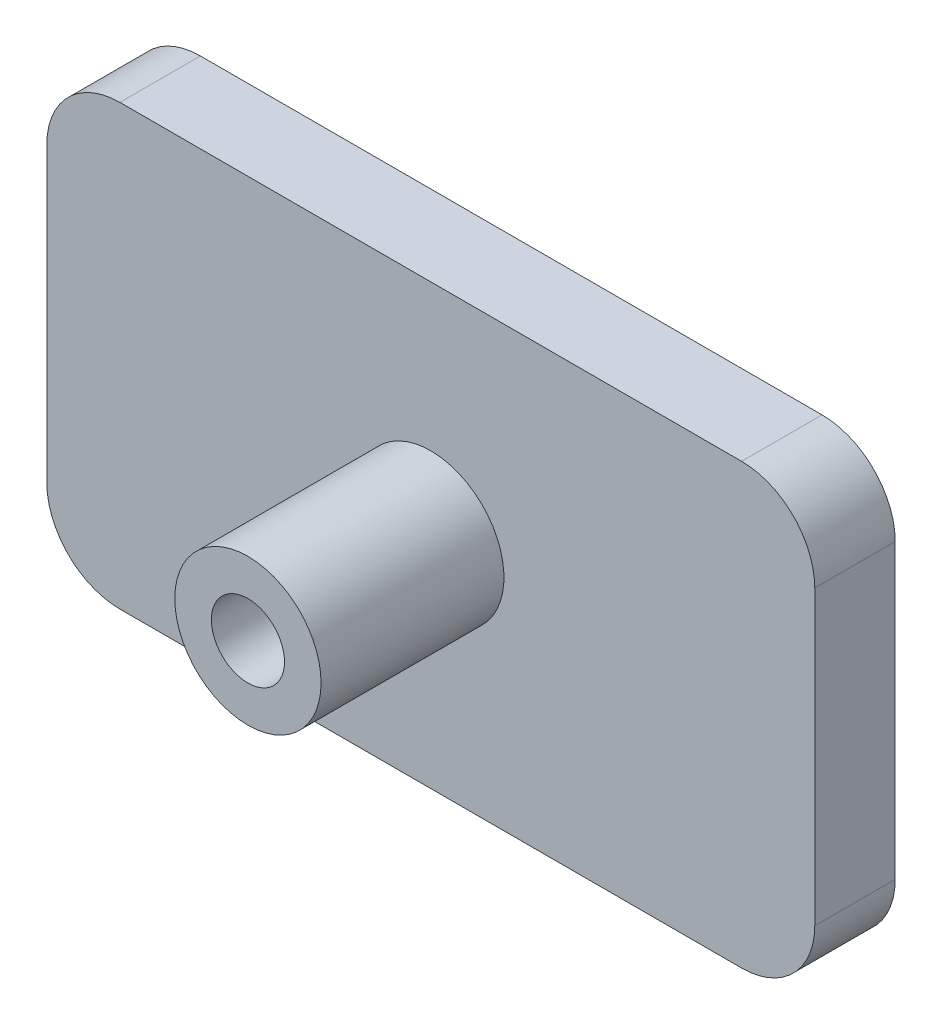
ISO-10303-21;
HEADER;
FILE_DESCRIPTION(('STEP AP214'),'2;1');
FILE_NAME('part.step','',(''),(''),'','','');
FILE_SCHEMA(('AUTOMOTIVE_DESIGN { 1 0 10303 214 1 1 1 1 }'));
ENDSEC;
DATA;
#1=APPLICATION_CONTEXT('core data for automotive mechanical design processes');
#2=APPLICATION_PROTOCOL_DEFINITION('international standard','automotive_design',2000,#1);
#3=PRODUCT_CONTEXT('',#1,'mechanical');
#4=PRODUCT('Part','Part','',(#3));
#5=PRODUCT_RELATED_PRODUCT_CATEGORY('part','',(#4));
#6=PRODUCT_DEFINITION_FORMATION('','',#4);
#7=PRODUCT_DEFINITION_CONTEXT('part definition',#1,'design');
#8=PRODUCT_DEFINITION('design','',#6,#7);
#9=PRODUCT_DEFINITION_SHAPE('','',#8);
#10=(LENGTH_UNIT() NAMED_UNIT(*) SI_UNIT(.MILLI.,.METRE.));
#11=(NAMED_UNIT(*) PLANE_ANGLE_UNIT() SI_UNIT($,.RADIAN.));
#12=(NAMED_UNIT(*) SI_UNIT($,.STERADIAN.) SOLID_ANGLE_UNIT());
#13=UNCERTAINTY_MEASURE_WITH_UNIT(LENGTH_MEASURE(1.E-05),#10,'distance_accuracy_value','');
#14=(GEOMETRIC_REPRESENTATION_CONTEXT(3) GLOBAL_UNCERTAINTY_ASSIGNED_CONTEXT((#13)) GLOBAL_UNIT_ASSIGNED_CONTEXT((#10,
#11,#12)) REPRESENTATION_CONTEXT('',''));
#15=CARTESIAN_POINT('',(0.,0.,0.));
#16=DIRECTION('',(0.,0.,1.));
#17=DIRECTION('',(1.,0.,0.));
#18=AXIS2_PLACEMENT_3D('',#15,#16,#17);
#19=CARTESIAN_POINT('',(-8.49999999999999,-4.,2.2));
#20=DIRECTION('',(0.,0.,-1.));
#21=DIRECTION('',(-1.,0.,0.));
#22=AXIS2_PLACEMENT_3D('',#19,#20,#21);
#23=PLANE('',#22);
#24=CARTESIAN_POINT('',(-8.49999999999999,-4.,2.2));
#25=DIRECTION('',(0.,0.,1.));
#26=DIRECTION('',(-1.,0.,0.));
#27=AXIS2_PLACEMENT_3D('',#24,#25,#26);
#28=CIRCLE('',#27,2.);
#29=CARTESIAN_POINT('',(-10.5,-3.99999999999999,2.2));
#30=VERTEX_POINT('',#29);
#31=CARTESIAN_POINT('',(-8.49999999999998,-6.,2.2));
#32=VERTEX_POINT('',#31);
#33=EDGE_CURVE('E157',#30,#32,#28,.T.);
#34=ORIENTED_EDGE('',*,*,#33,.T.);
#35=DIRECTION('',(1.,0.,0.));
#36=VECTOR('',#35,1.);
#37=CARTESIAN_POINT('',(-8.49999999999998,-6.,2.2));
#38=LINE('',#37,#36);
#39=CARTESIAN_POINT('',(8.49999999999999,-6.,2.2));
#40=VERTEX_POINT('',#39);
#41=EDGE_CURVE('E97',#32,#40,#38,.T.);
#42=ORIENTED_EDGE('',*,*,#41,.T.);
#43=CARTESIAN_POINT('',(8.50000000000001,-4.,2.2));
#44=DIRECTION('',(0.,0.,1.));
#45=DIRECTION('',(1.,0.,0.));
#46=AXIS2_PLACEMENT_3D('',#43,#44,#45);
#47=CIRCLE('',#46,2.);
#48=CARTESIAN_POINT('',(10.5,-3.99999999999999,2.2));
#49=VERTEX_POINT('',#48);
#50=EDGE_CURVE('E205',#40,#49,#47,.T.);
#51=ORIENTED_EDGE('',*,*,#50,.T.);
#52=DIRECTION('',(0.,1.,0.));
#53=VECTOR('',#52,1.);
#54=CARTESIAN_POINT('',(10.5,-3.99999999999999,2.2));
#55=LINE('',#54,#53);
#56=CARTESIAN_POINT('',(10.5,3.99999999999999,2.2));
#57=VERTEX_POINT('',#56);
#58=EDGE_CURVE('E207',#49,#57,#55,.T.);
#59=ORIENTED_EDGE('',*,*,#58,.T.);
#60=CARTESIAN_POINT('',(8.50000000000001,4.,2.2));
#61=DIRECTION('',(0.,0.,1.));
#62=DIRECTION('',(-1.,0.,0.));
#63=AXIS2_PLACEMENT_3D('',#60,#61,#62);
#64=CIRCLE('',#63,2.);
#65=CARTESIAN_POINT('',(8.49999999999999,6.,2.2));
#66=VERTEX_POINT('',#65);
#67=EDGE_CURVE('E120',#57,#66,#64,.T.);
#68=ORIENTED_EDGE('',*,*,#67,.T.);
#69=DIRECTION('',(-1.,0.,0.));
#70=VECTOR('',#69,1.);
#71=CARTESIAN_POINT('',(-8.49999999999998,6.,2.2));
#72=LINE('',#71,#70);
#73=CARTESIAN_POINT('',(-8.49999999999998,6.,2.2));
#74=VERTEX_POINT('',#73);
#75=EDGE_CURVE('E113',#66,#74,#72,.T.);
#76=ORIENTED_EDGE('',*,*,#75,.T.);
#77=CARTESIAN_POINT('',(-8.49999999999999,4.,2.2));
#78=DIRECTION('',(0.,0.,1.));
#79=DIRECTION('',(-1.,0.,0.));
#80=AXIS2_PLACEMENT_3D('',#77,#78,#79);
#81=CIRCLE('',#80,2.);
#82=CARTESIAN_POINT('',(-10.5,3.99999999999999,2.2));
#83=VERTEX_POINT('',#82);
#84=EDGE_CURVE('E117',#74,#83,#81,.T.);
#85=ORIENTED_EDGE('',*,*,#84,.T.);
#86=DIRECTION('',(0.,-1.,0.));
#87=VECTOR('',#86,1.);
#88=CARTESIAN_POINT('',(-10.5,-3.99999999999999,2.2));
#89=LINE('',#88,#87);
#90=EDGE_CURVE('E55',#83,#30,#89,.T.);
#91=ORIENTED_EDGE('',*,*,#90,.T.);
#92=EDGE_LOOP('',(#34,#42,#51,#59,#68,#76,#85,#91));
#93=FACE_BOUND('',#92,.T.);
#94=CARTESIAN_POINT('',(0.,0.,2.2));
#95=DIRECTION('',(0.,0.,-1.));
#96=DIRECTION('',(-1.,0.,0.));
#97=AXIS2_PLACEMENT_3D('',#94,#95,#96);
#98=CIRCLE('',#97,2.);
#99=CARTESIAN_POINT('',(-2.,0.,2.2));
#100=VERTEX_POINT('',#99);
#101=EDGE_CURVE('E11',#100,#100,#98,.F.);
#102=ORIENTED_EDGE('',*,*,#101,.F.);
#103=EDGE_LOOP('',(#102));
#104=FACE_BOUND('',#103,.T.);
#105=ADVANCED_FACE('F31',(#93,#104),#23,.F.);
#106=CARTESIAN_POINT('',(-8.49999999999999,-4.,0.));
#107=DIRECTION('',(0.,0.,-1.));
#108=DIRECTION('',(-1.,0.,0.));
#109=AXIS2_PLACEMENT_3D('',#106,#107,#108);
#110=PLANE('',#109);
#111=CARTESIAN_POINT('',(-8.5,4.,0.));
#112=DIRECTION('',(0.,0.,-1.));
#113=DIRECTION('',(1.,0.,0.));
#114=AXIS2_PLACEMENT_3D('',#111,#112,#113);
#115=CIRCLE('',#114,1.);
#116=CARTESIAN_POINT('',(-9.5,3.99999999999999,0.));
#117=VERTEX_POINT('',#116);
#118=CARTESIAN_POINT('',(-8.49999999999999,5.,0.));
#119=VERTEX_POINT('',#118);
#120=EDGE_CURVE('E46',#117,#119,#115,.T.);
#121=ORIENTED_EDGE('',*,*,#120,.F.);
#122=DIRECTION('',(0.,1.,0.));
#123=VECTOR('',#122,1.);
#124=CARTESIAN_POINT('',(-9.5,-3.99999999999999,0.));
#125=LINE('',#124,#123);
#126=CARTESIAN_POINT('',(-9.5,-3.99999999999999,0.));
#127=VERTEX_POINT('',#126);
#128=EDGE_CURVE('E183',#127,#117,#125,.T.);
#129=ORIENTED_EDGE('',*,*,#128,.F.);
#130=CARTESIAN_POINT('',(-8.5,-4.,0.));
#131=DIRECTION('',(0.,0.,-1.));
#132=DIRECTION('',(-1.,0.,0.));
#133=AXIS2_PLACEMENT_3D('',#130,#131,#132);
#134=CIRCLE('',#133,1.);
#135=CARTESIAN_POINT('',(-8.49999999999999,-5.,0.));
#136=VERTEX_POINT('',#135);
#137=EDGE_CURVE('E477',#136,#127,#134,.T.);
#138=ORIENTED_EDGE('',*,*,#137,.F.);
#139=DIRECTION('',(-1.,0.,0.));
#140=VECTOR('',#139,1.);
#141=CARTESIAN_POINT('',(8.49999999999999,-5.,0.));
#142=LINE('',#141,#140);
#143=CARTESIAN_POINT('',(8.49999999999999,-5.,0.));
#144=VERTEX_POINT('',#143);
#145=EDGE_CURVE('E475',#144,#136,#142,.T.);
#146=ORIENTED_EDGE('',*,*,#145,.F.);
#147=CARTESIAN_POINT('',(8.5,-4.,0.));
#148=DIRECTION('',(0.,0.,-1.));
#149=DIRECTION('',(1.,0.,0.));
#150=AXIS2_PLACEMENT_3D('',#147,#148,#149);
#151=CIRCLE('',#150,1.);
#152=CARTESIAN_POINT('',(9.5,-3.99999999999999,0.));
#153=VERTEX_POINT('',#152);
#154=EDGE_CURVE('E472',#153,#144,#151,.T.);
#155=ORIENTED_EDGE('',*,*,#154,.F.);
#156=DIRECTION('',(0.,-1.,0.));
#157=VECTOR('',#156,1.);
#158=CARTESIAN_POINT('',(9.5,-3.99999999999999,0.));
#159=LINE('',#158,#157);
#160=CARTESIAN_POINT('',(9.5,3.99999999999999,0.));
#161=VERTEX_POINT('',#160);
#162=EDGE_CURVE('E469',#161,#153,#159,.T.);
#163=ORIENTED_EDGE('',*,*,#162,.F.);
#164=CARTESIAN_POINT('',(8.5,4.,0.));
#165=DIRECTION('',(0.,0.,-1.));
#166=DIRECTION('',(1.,0.,0.));
#167=AXIS2_PLACEMENT_3D('',#164,#165,#166);
#168=CIRCLE('',#167,1.);
#169=CARTESIAN_POINT('',(8.49999999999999,5.,0.));
#170=VERTEX_POINT('',#169);
#171=EDGE_CURVE('E466',#170,#161,#168,.T.);
#172=ORIENTED_EDGE('',*,*,#171,.F.);
#173=DIRECTION('',(1.,0.,0.));
#174=VECTOR('',#173,1.);
#175=CARTESIAN_POINT('',(8.49999999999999,5.,0.));
#176=LINE('',#175,#174);
#177=EDGE_CURVE('E436',#119,#170,#176,.T.);
#178=ORIENTED_EDGE('',*,*,#177,.F.);
#179=EDGE_LOOP('',(#121,#129,#138,#146,#155,#163,#172,#178));
#180=FACE_BOUND('',#179,.T.);
#181=CARTESIAN_POINT('',(-8.49999999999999,-4.,0.));
#182=DIRECTION('',(0.,0.,1.));
#183=DIRECTION('',(-1.,0.,0.));
#184=AXIS2_PLACEMENT_3D('',#181,#182,#183);
#185=CIRCLE('',#184,2.);
#186=CARTESIAN_POINT('',(-10.5,-3.99999999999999,0.));
#187=VERTEX_POINT('',#186);
#188=CARTESIAN_POINT('',(-8.49999999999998,-6.,0.));
#189=VERTEX_POINT('',#188);
#190=EDGE_CURVE('E141',#187,#189,#185,.T.);
#191=ORIENTED_EDGE('',*,*,#190,.F.);
#192=DIRECTION('',(0.,-1.,0.));
#193=VECTOR('',#192,1.);
#194=CARTESIAN_POINT('',(-10.5,-3.99999999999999,0.));
#195=LINE('',#194,#193);
#196=CARTESIAN_POINT('',(-10.5,3.99999999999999,0.));
#197=VERTEX_POINT('',#196);
#198=EDGE_CURVE('E88',#197,#187,#195,.T.);
#199=ORIENTED_EDGE('',*,*,#198,.F.);
#200=CARTESIAN_POINT('',(-8.49999999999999,4.,0.));
#201=DIRECTION('',(0.,0.,1.));
#202=DIRECTION('',(-1.,0.,0.));
#203=AXIS2_PLACEMENT_3D('',#200,#201,#202);
#204=CIRCLE('',#203,2.);
#205=CARTESIAN_POINT('',(-8.49999999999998,6.,0.));
#206=VERTEX_POINT('',#205);
#207=EDGE_CURVE('E154',#206,#197,#204,.T.);
#208=ORIENTED_EDGE('',*,*,#207,.F.);
#209=DIRECTION('',(-1.,0.,0.));
#210=VECTOR('',#209,1.);
#211=CARTESIAN_POINT('',(-8.49999999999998,6.,0.));
#212=LINE('',#211,#210);
#213=CARTESIAN_POINT('',(8.49999999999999,6.,0.));
#214=VERTEX_POINT('',#213);
#215=EDGE_CURVE('E129',#214,#206,#212,.T.);
#216=ORIENTED_EDGE('',*,*,#215,.F.);
#217=CARTESIAN_POINT('',(8.50000000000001,4.,0.));
#218=DIRECTION('',(0.,0.,1.));
#219=DIRECTION('',(-1.,0.,0.));
#220=AXIS2_PLACEMENT_3D('',#217,#218,#219);
#221=CIRCLE('',#220,2.);
#222=CARTESIAN_POINT('',(10.5,3.99999999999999,0.));
#223=VERTEX_POINT('',#222);
#224=EDGE_CURVE('E151',#223,#214,#221,.T.);
#225=ORIENTED_EDGE('',*,*,#224,.F.);
#226=DIRECTION('',(0.,1.,0.));
#227=VECTOR('',#226,1.);
#228=CARTESIAN_POINT('',(10.5,-3.99999999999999,0.));
#229=LINE('',#228,#227);
#230=CARTESIAN_POINT('',(10.5,-3.99999999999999,0.));
#231=VERTEX_POINT('',#230);
#232=EDGE_CURVE('E149',#231,#223,#229,.T.);
#233=ORIENTED_EDGE('',*,*,#232,.F.);
#234=CARTESIAN_POINT('',(8.50000000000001,-4.,0.));
#235=DIRECTION('',(0.,0.,1.));
#236=DIRECTION('',(1.,0.,0.));
#237=AXIS2_PLACEMENT_3D('',#234,#235,#236);
#238=CIRCLE('',#237,2.);
#239=CARTESIAN_POINT('',(8.49999999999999,-6.,0.));
#240=VERTEX_POINT('',#239);
#241=EDGE_CURVE('E147',#240,#231,#238,.T.);
#242=ORIENTED_EDGE('',*,*,#241,.F.);
#243=DIRECTION('',(1.,0.,0.));
#244=VECTOR('',#243,1.);
#245=CARTESIAN_POINT('',(-8.49999999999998,-6.,0.));
#246=LINE('',#245,#244);
#247=EDGE_CURVE('E144',#189,#240,#246,.T.);
#248=ORIENTED_EDGE('',*,*,#247,.F.);
#249=EDGE_LOOP('',(#191,#199,#208,#216,#225,#233,#242,#248));
#250=FACE_BOUND('',#249,.T.);
#251=ADVANCED_FACE('F220',(#180,#250),#110,.T.);
#252=CARTESIAN_POINT('',(-8.49999999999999,-4.,2.2));
#253=DIRECTION('',(0.,0.,-1.));
#254=DIRECTION('',(-1.,0.,0.));
#255=AXIS2_PLACEMENT_3D('',#252,#253,#254);
#256=CYLINDRICAL_SURFACE('',#255,2.);
#257=ORIENTED_EDGE('',*,*,#190,.T.);
#258=DIRECTION('',(0.,0.,-1.));
#259=VECTOR('',#258,1.);
#260=CARTESIAN_POINT('',(-8.49999999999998,-6.,2.2));
#261=LINE('',#260,#259);
#262=EDGE_CURVE('E39',#32,#189,#261,.T.);
#263=ORIENTED_EDGE('',*,*,#262,.F.);
#264=ORIENTED_EDGE('',*,*,#33,.F.);
#265=DIRECTION('',(0.,0.,-1.));
#266=VECTOR('',#265,1.);
#267=CARTESIAN_POINT('',(-10.5,-3.99999999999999,2.2));
#268=LINE('',#267,#266);
#269=EDGE_CURVE('E137',#30,#187,#268,.T.);
#270=ORIENTED_EDGE('',*,*,#269,.T.);
#271=EDGE_LOOP('',(#257,#263,#264,#270));
#272=FACE_BOUND('',#271,.T.);
#273=ADVANCED_FACE('F33',(#272),#256,.T.);
#274=CARTESIAN_POINT('',(-8.49999999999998,-6.,2.2));
#275=DIRECTION('',(0.,1.,0.));
#276=DIRECTION('',(0.,0.,1.));
#277=AXIS2_PLACEMENT_3D('',#274,#275,#276);
#278=PLANE('',#277);
#279=ORIENTED_EDGE('',*,*,#247,.T.);
#280=DIRECTION('',(0.,0.,-1.));
#281=VECTOR('',#280,1.);
#282=CARTESIAN_POINT('',(8.49999999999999,-6.,2.2));
#283=LINE('',#282,#281);
#284=EDGE_CURVE('E167',#40,#240,#283,.T.);
#285=ORIENTED_EDGE('',*,*,#284,.F.);
#286=ORIENTED_EDGE('',*,*,#41,.F.);
#287=ORIENTED_EDGE('',*,*,#262,.T.);
#288=EDGE_LOOP('',(#279,#285,#286,#287));
#289=FACE_BOUND('',#288,.T.);
#290=ADVANCED_FACE('F225',(#289),#278,.F.);
#291=CARTESIAN_POINT('',(8.50000000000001,-4.,2.2));
#292=DIRECTION('',(0.,0.,-1.));
#293=DIRECTION('',(-1.,0.,0.));
#294=AXIS2_PLACEMENT_3D('',#291,#292,#293);
#295=CYLINDRICAL_SURFACE('',#294,2.);
#296=ORIENTED_EDGE('',*,*,#241,.T.);
#297=DIRECTION('',(0.,0.,-1.));
#298=VECTOR('',#297,1.);
#299=CARTESIAN_POINT('',(10.5,-3.99999999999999,2.2));
#300=LINE('',#299,#298);
#301=EDGE_CURVE('E164',#49,#231,#300,.T.);
#302=ORIENTED_EDGE('',*,*,#301,.F.);
#303=ORIENTED_EDGE('',*,*,#50,.F.);
#304=ORIENTED_EDGE('',*,*,#284,.T.);
#305=EDGE_LOOP('',(#296,#302,#303,#304));
#306=FACE_BOUND('',#305,.T.);
#307=ADVANCED_FACE('F228',(#306),#295,.T.);
#308=CARTESIAN_POINT('',(10.5,-3.99999999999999,2.2));
#309=DIRECTION('',(-1.,0.,0.));
#310=DIRECTION('',(0.,0.,1.));
#311=AXIS2_PLACEMENT_3D('',#308,#309,#310);
#312=PLANE('',#311);
#313=ORIENTED_EDGE('',*,*,#232,.T.);
#314=DIRECTION('',(0.,0.,-1.));
#315=VECTOR('',#314,1.);
#316=CARTESIAN_POINT('',(10.5,3.99999999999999,2.2));
#317=LINE('',#316,#315);
#318=EDGE_CURVE('E161',#57,#223,#317,.T.);
#319=ORIENTED_EDGE('',*,*,#318,.F.);
#320=ORIENTED_EDGE('',*,*,#58,.F.);
#321=ORIENTED_EDGE('',*,*,#301,.T.);
#322=EDGE_LOOP('',(#313,#319,#320,#321));
#323=FACE_BOUND('',#322,.T.);
#324=ADVANCED_FACE('F213',(#323),#312,.F.);
#325=CARTESIAN_POINT('',(8.50000000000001,4.,2.2));
#326=DIRECTION('',(0.,0.,-1.));
#327=DIRECTION('',(-1.,0.,0.));
#328=AXIS2_PLACEMENT_3D('',#325,#326,#327);
#329=CYLINDRICAL_SURFACE('',#328,2.);
#330=ORIENTED_EDGE('',*,*,#224,.T.);
#331=DIRECTION('',(0.,0.,-1.));
#332=VECTOR('',#331,1.);
#333=CARTESIAN_POINT('',(8.49999999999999,6.,2.2));
#334=LINE('',#333,#332);
#335=EDGE_CURVE('E132',#66,#214,#334,.T.);
#336=ORIENTED_EDGE('',*,*,#335,.F.);
#337=ORIENTED_EDGE('',*,*,#67,.F.);
#338=ORIENTED_EDGE('',*,*,#318,.T.);
#339=EDGE_LOOP('',(#330,#336,#337,#338));
#340=FACE_BOUND('',#339,.T.);
#341=ADVANCED_FACE('F217',(#340),#329,.T.);
#342=CARTESIAN_POINT('',(-8.49999999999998,6.,2.2));
#343=DIRECTION('',(0.,-1.,0.));
#344=DIRECTION('',(0.,0.,-1.));
#345=AXIS2_PLACEMENT_3D('',#342,#343,#344);
#346=PLANE('',#345);
#347=ORIENTED_EDGE('',*,*,#215,.T.);
#348=DIRECTION('',(0.,0.,-1.));
#349=VECTOR('',#348,1.);
#350=CARTESIAN_POINT('',(-8.49999999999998,6.,2.2));
#351=LINE('',#350,#349);
#352=EDGE_CURVE('E126',#74,#206,#351,.T.);
#353=ORIENTED_EDGE('',*,*,#352,.F.);
#354=ORIENTED_EDGE('',*,*,#75,.F.);
#355=ORIENTED_EDGE('',*,*,#335,.T.);
#356=EDGE_LOOP('',(#347,#353,#354,#355));
#357=FACE_BOUND('',#356,.T.);
#358=ADVANCED_FACE('F127',(#357),#346,.F.);
#359=CARTESIAN_POINT('',(-8.49999999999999,4.,2.2));
#360=DIRECTION('',(0.,0.,-1.));
#361=DIRECTION('',(-1.,0.,0.));
#362=AXIS2_PLACEMENT_3D('',#359,#360,#361);
#363=CYLINDRICAL_SURFACE('',#362,2.);
#364=ORIENTED_EDGE('',*,*,#207,.T.);
#365=DIRECTION('',(0.,0.,-1.));
#366=VECTOR('',#365,1.);
#367=CARTESIAN_POINT('',(-10.5,3.99999999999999,2.2));
#368=LINE('',#367,#366);
#369=EDGE_CURVE('E133',#83,#197,#368,.T.);
#370=ORIENTED_EDGE('',*,*,#369,.F.);
#371=ORIENTED_EDGE('',*,*,#84,.F.);
#372=ORIENTED_EDGE('',*,*,#352,.T.);
#373=EDGE_LOOP('',(#364,#370,#371,#372));
#374=FACE_BOUND('',#373,.T.);
#375=ADVANCED_FACE('F135',(#374),#363,.T.);
#376=CARTESIAN_POINT('',(-10.5,-3.99999999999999,2.2));
#377=DIRECTION('',(1.,0.,0.));
#378=DIRECTION('',(0.,0.,-1.));
#379=AXIS2_PLACEMENT_3D('',#376,#377,#378);
#380=PLANE('',#379);
#381=ORIENTED_EDGE('',*,*,#198,.T.);
#382=ORIENTED_EDGE('',*,*,#269,.F.);
#383=ORIENTED_EDGE('',*,*,#90,.F.);
#384=ORIENTED_EDGE('',*,*,#369,.T.);
#385=EDGE_LOOP('',(#381,#382,#383,#384));
#386=FACE_BOUND('',#385,.T.);
#387=ADVANCED_FACE('F221',(#386),#380,.F.);
#388=CARTESIAN_POINT('',(0.,0.,2.2));
#389=DIRECTION('',(0.,0.,-1.));
#390=DIRECTION('',(-1.,0.,0.));
#391=AXIS2_PLACEMENT_3D('',#388,#389,#390);
#392=CYLINDRICAL_SURFACE('',#391,1.);
#393=CARTESIAN_POINT('',(0.,0.,1.1));
#394=DIRECTION('',(0.,0.,1.));
#395=DIRECTION('',(1.,0.,0.));
#396=AXIS2_PLACEMENT_3D('',#393,#394,#395);
#397=CIRCLE('',#396,1.);
#398=CARTESIAN_POINT('',(1.00000000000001,0.,1.1));
#399=VERTEX_POINT('',#398);
#400=EDGE_CURVE('E145',#399,#399,#397,.T.);
#401=ORIENTED_EDGE('',*,*,#400,.F.);
#402=EDGE_LOOP('',(#401));
#403=FACE_BOUND('',#402,.T.);
#404=CARTESIAN_POINT('',(0.,0.,7.2));
#405=DIRECTION('',(0.,0.,1.));
#406=DIRECTION('',(1.,0.,0.));
#407=AXIS2_PLACEMENT_3D('',#404,#405,#406);
#408=CIRCLE('',#407,1.00000000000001);
#409=CARTESIAN_POINT('',(1.00000000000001,0.,7.2));
#410=VERTEX_POINT('',#409);
#411=EDGE_CURVE('E434',#410,#410,#408,.T.);
#412=ORIENTED_EDGE('',*,*,#411,.T.);
#413=EDGE_LOOP('',(#412));
#414=FACE_BOUND('',#413,.T.);
#415=ADVANCED_FACE('F244',(#403,#414),#392,.F.);
#416=CARTESIAN_POINT('',(-8.5,4.,1.1));
#417=DIRECTION('',(0.,0.,-1.));
#418=DIRECTION('',(-1.,0.,0.));
#419=AXIS2_PLACEMENT_3D('',#416,#417,#418);
#420=CYLINDRICAL_SURFACE('',#419,1.);
#421=ORIENTED_EDGE('',*,*,#120,.T.);
#422=DIRECTION('',(0.,0.,-1.));
#423=VECTOR('',#422,1.);
#424=CARTESIAN_POINT('',(-8.49999999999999,5.,1.1));
#425=LINE('',#424,#423);
#426=CARTESIAN_POINT('',(-8.49999999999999,5.,1.1));
#427=VERTEX_POINT('',#426);
#428=EDGE_CURVE('E200',#427,#119,#425,.T.);
#429=ORIENTED_EDGE('',*,*,#428,.F.);
#430=CARTESIAN_POINT('',(-8.5,4.,1.1));
#431=DIRECTION('',(0.,0.,-1.));
#432=DIRECTION('',(1.,0.,0.));
#433=AXIS2_PLACEMENT_3D('',#430,#431,#432);
#434=CIRCLE('',#433,1.);
#435=CARTESIAN_POINT('',(-9.5,3.99999999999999,1.1));
#436=VERTEX_POINT('',#435);
#437=EDGE_CURVE('E441',#436,#427,#434,.T.);
#438=ORIENTED_EDGE('',*,*,#437,.F.);
#439=DIRECTION('',(0.,0.,-1.));
#440=VECTOR('',#439,1.);
#441=CARTESIAN_POINT('',(-9.5,3.99999999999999,1.1));
#442=LINE('',#441,#440);
#443=EDGE_CURVE('E171',#436,#117,#442,.T.);
#444=ORIENTED_EDGE('',*,*,#443,.T.);
#445=EDGE_LOOP('',(#421,#429,#438,#444));
#446=FACE_BOUND('',#445,.T.);
#447=ADVANCED_FACE('F277',(#446),#420,.F.);
#448=CARTESIAN_POINT('',(-9.5,-3.99999999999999,1.1));
#449=DIRECTION('',(-1.,0.,0.));
#450=DIRECTION('',(0.,0.,1.));
#451=AXIS2_PLACEMENT_3D('',#448,#449,#450);
#452=PLANE('',#451);
#453=ORIENTED_EDGE('',*,*,#128,.T.);
#454=ORIENTED_EDGE('',*,*,#443,.F.);
#455=DIRECTION('',(0.,1.,0.));
#456=VECTOR('',#455,1.);
#457=CARTESIAN_POINT('',(-9.5,-3.99999999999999,1.1));
#458=LINE('',#457,#456);
#459=CARTESIAN_POINT('',(-9.5,-3.99999999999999,1.1));
#460=VERTEX_POINT('',#459);
#461=EDGE_CURVE('E202',#460,#436,#458,.T.);
#462=ORIENTED_EDGE('',*,*,#461,.F.);
#463=DIRECTION('',(0.,0.,-1.));
#464=VECTOR('',#463,1.);
#465=CARTESIAN_POINT('',(-9.5,-3.99999999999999,1.1));
#466=LINE('',#465,#464);
#467=EDGE_CURVE('E174',#460,#127,#466,.T.);
#468=ORIENTED_EDGE('',*,*,#467,.T.);
#469=EDGE_LOOP('',(#453,#454,#462,#468));
#470=FACE_BOUND('',#469,.T.);
#471=ADVANCED_FACE('F285',(#470),#452,.F.);
#472=CARTESIAN_POINT('',(-8.5,-4.,1.1));
#473=DIRECTION('',(0.,0.,-1.));
#474=DIRECTION('',(-1.,0.,0.));
#475=AXIS2_PLACEMENT_3D('',#472,#473,#474);
#476=CYLINDRICAL_SURFACE('',#475,1.);
#477=ORIENTED_EDGE('',*,*,#137,.T.);
#478=ORIENTED_EDGE('',*,*,#467,.F.);
#479=CARTESIAN_POINT('',(-8.5,-4.,1.1));
#480=DIRECTION('',(0.,0.,-1.));
#481=DIRECTION('',(-1.,0.,0.));
#482=AXIS2_PLACEMENT_3D('',#479,#480,#481);
#483=CIRCLE('',#482,1.);
#484=CARTESIAN_POINT('',(-8.49999999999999,-5.,1.1));
#485=VERTEX_POINT('',#484);
#486=EDGE_CURVE('E459',#485,#460,#483,.T.);
#487=ORIENTED_EDGE('',*,*,#486,.F.);
#488=DIRECTION('',(0.,0.,-1.));
#489=VECTOR('',#488,1.);
#490=CARTESIAN_POINT('',(-8.49999999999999,-5.,1.1));
#491=LINE('',#490,#489);
#492=EDGE_CURVE('E180',#485,#136,#491,.T.);
#493=ORIENTED_EDGE('',*,*,#492,.T.);
#494=EDGE_LOOP('',(#477,#478,#487,#493));
#495=FACE_BOUND('',#494,.T.);
#496=ADVANCED_FACE('F291',(#495),#476,.F.);
#497=CARTESIAN_POINT('',(8.49999999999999,-5.,1.1));
#498=DIRECTION('',(0.,-1.,0.));
#499=DIRECTION('',(0.,0.,-1.));
#500=AXIS2_PLACEMENT_3D('',#497,#498,#499);
#501=PLANE('',#500);
#502=ORIENTED_EDGE('',*,*,#145,.T.);
#503=ORIENTED_EDGE('',*,*,#492,.F.);
#504=DIRECTION('',(-1.,0.,0.));
#505=VECTOR('',#504,1.);
#506=CARTESIAN_POINT('',(8.49999999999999,-5.,1.1));
#507=LINE('',#506,#505);
#508=CARTESIAN_POINT('',(8.49999999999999,-5.,1.1));
#509=VERTEX_POINT('',#508);
#510=EDGE_CURVE('E456',#509,#485,#507,.T.);
#511=ORIENTED_EDGE('',*,*,#510,.F.);
#512=DIRECTION('',(0.,0.,-1.));
#513=VECTOR('',#512,1.);
#514=CARTESIAN_POINT('',(8.49999999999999,-5.,1.1));
#515=LINE('',#514,#513);
#516=EDGE_CURVE('E188',#509,#144,#515,.T.);
#517=ORIENTED_EDGE('',*,*,#516,.T.);
#518=EDGE_LOOP('',(#502,#503,#511,#517));
#519=FACE_BOUND('',#518,.T.);
#520=ADVANCED_FACE('F299',(#519),#501,.F.);
#521=CARTESIAN_POINT('',(8.5,-4.,1.1));
#522=DIRECTION('',(0.,0.,-1.));
#523=DIRECTION('',(-1.,0.,0.));
#524=AXIS2_PLACEMENT_3D('',#521,#522,#523);
#525=CYLINDRICAL_SURFACE('',#524,1.);
#526=ORIENTED_EDGE('',*,*,#154,.T.);
#527=ORIENTED_EDGE('',*,*,#516,.F.);
#528=CARTESIAN_POINT('',(8.5,-4.,1.1));
#529=DIRECTION('',(0.,0.,-1.));
#530=DIRECTION('',(1.,0.,0.));
#531=AXIS2_PLACEMENT_3D('',#528,#529,#530);
#532=CIRCLE('',#531,1.);
#533=CARTESIAN_POINT('',(9.5,-3.99999999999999,1.1));
#534=VERTEX_POINT('',#533);
#535=EDGE_CURVE('E453',#534,#509,#532,.T.);
#536=ORIENTED_EDGE('',*,*,#535,.F.);
#537=DIRECTION('',(0.,0.,-1.));
#538=VECTOR('',#537,1.);
#539=CARTESIAN_POINT('',(9.5,-3.99999999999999,1.1));
#540=LINE('',#539,#538);
#541=EDGE_CURVE('E191',#534,#153,#540,.T.);
#542=ORIENTED_EDGE('',*,*,#541,.T.);
#543=EDGE_LOOP('',(#526,#527,#536,#542));
#544=FACE_BOUND('',#543,.T.);
#545=ADVANCED_FACE('F307',(#544),#525,.F.);
#546=CARTESIAN_POINT('',(9.5,-3.99999999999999,1.1));
#547=DIRECTION('',(1.,0.,0.));
#548=DIRECTION('',(0.,0.,-1.));
#549=AXIS2_PLACEMENT_3D('',#546,#547,#548);
#550=PLANE('',#549);
#551=ORIENTED_EDGE('',*,*,#162,.T.);
#552=ORIENTED_EDGE('',*,*,#541,.F.);
#553=DIRECTION('',(0.,-1.,0.));
#554=VECTOR('',#553,1.);
#555=CARTESIAN_POINT('',(9.5,-3.99999999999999,1.1));
#556=LINE('',#555,#554);
#557=CARTESIAN_POINT('',(9.5,3.99999999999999,1.1));
#558=VERTEX_POINT('',#557);
#559=EDGE_CURVE('E450',#558,#534,#556,.T.);
#560=ORIENTED_EDGE('',*,*,#559,.F.);
#561=DIRECTION('',(0.,0.,-1.));
#562=VECTOR('',#561,1.);
#563=CARTESIAN_POINT('',(9.5,3.99999999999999,1.1));
#564=LINE('',#563,#562);
#565=EDGE_CURVE('E194',#558,#161,#564,.T.);
#566=ORIENTED_EDGE('',*,*,#565,.T.);
#567=EDGE_LOOP('',(#551,#552,#560,#566));
#568=FACE_BOUND('',#567,.T.);
#569=ADVANCED_FACE('F315',(#568),#550,.F.);
#570=CARTESIAN_POINT('',(8.5,4.,1.1));
#571=DIRECTION('',(0.,0.,-1.));
#572=DIRECTION('',(-1.,0.,0.));
#573=AXIS2_PLACEMENT_3D('',#570,#571,#572);
#574=CYLINDRICAL_SURFACE('',#573,1.);
#575=ORIENTED_EDGE('',*,*,#171,.T.);
#576=ORIENTED_EDGE('',*,*,#565,.F.);
#577=CARTESIAN_POINT('',(8.5,4.,1.1));
#578=DIRECTION('',(0.,0.,-1.));
#579=DIRECTION('',(1.,0.,0.));
#580=AXIS2_PLACEMENT_3D('',#577,#578,#579);
#581=CIRCLE('',#580,1.);
#582=CARTESIAN_POINT('',(8.49999999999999,5.,1.1));
#583=VERTEX_POINT('',#582);
#584=EDGE_CURVE('E447',#583,#558,#581,.T.);
#585=ORIENTED_EDGE('',*,*,#584,.F.);
#586=DIRECTION('',(0.,0.,-1.));
#587=VECTOR('',#586,1.);
#588=CARTESIAN_POINT('',(8.49999999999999,5.,1.1));
#589=LINE('',#588,#587);
#590=EDGE_CURVE('E197',#583,#170,#589,.T.);
#591=ORIENTED_EDGE('',*,*,#590,.T.);
#592=EDGE_LOOP('',(#575,#576,#585,#591));
#593=FACE_BOUND('',#592,.T.);
#594=ADVANCED_FACE('F323',(#593),#574,.F.);
#595=CARTESIAN_POINT('',(8.49999999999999,5.,1.1));
#596=DIRECTION('',(0.,1.,0.));
#597=DIRECTION('',(0.,0.,1.));
#598=AXIS2_PLACEMENT_3D('',#595,#596,#597);
#599=PLANE('',#598);
#600=ORIENTED_EDGE('',*,*,#177,.T.);
#601=ORIENTED_EDGE('',*,*,#590,.F.);
#602=DIRECTION('',(1.,0.,0.));
#603=VECTOR('',#602,1.);
#604=CARTESIAN_POINT('',(8.49999999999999,5.,1.1));
#605=LINE('',#604,#603);
#606=EDGE_CURVE('E444',#427,#583,#605,.T.);
#607=ORIENTED_EDGE('',*,*,#606,.F.);
#608=ORIENTED_EDGE('',*,*,#428,.T.);
#609=EDGE_LOOP('',(#600,#601,#607,#608));
#610=FACE_BOUND('',#609,.T.);
#611=ADVANCED_FACE('F331',(#610),#599,.F.);
#612=CARTESIAN_POINT('',(-8.5,4.,1.1));
#613=DIRECTION('',(0.,0.,1.));
#614=DIRECTION('',(1.,0.,0.));
#615=AXIS2_PLACEMENT_3D('',#612,#613,#614);
#616=PLANE('',#615);
#617=ORIENTED_EDGE('',*,*,#400,.T.);
#618=EDGE_LOOP('',(#617));
#619=FACE_BOUND('',#618,.T.);
#620=ORIENTED_EDGE('',*,*,#437,.T.);
#621=ORIENTED_EDGE('',*,*,#606,.T.);
#622=ORIENTED_EDGE('',*,*,#584,.T.);
#623=ORIENTED_EDGE('',*,*,#559,.T.);
#624=ORIENTED_EDGE('',*,*,#535,.T.);
#625=ORIENTED_EDGE('',*,*,#510,.T.);
#626=ORIENTED_EDGE('',*,*,#486,.T.);
#627=ORIENTED_EDGE('',*,*,#461,.T.);
#628=EDGE_LOOP('',(#620,#621,#622,#623,#624,#625,#626,#627));
#629=FACE_BOUND('',#628,.T.);
#630=ADVANCED_FACE('F339',(#619,#629),#616,.F.);
#631=CARTESIAN_POINT('',(0.,0.,7.2));
#632=DIRECTION('',(0.,0.,1.));
#633=DIRECTION('',(1.,0.,0.));
#634=AXIS2_PLACEMENT_3D('',#631,#632,#633);
#635=PLANE('',#634);
#636=CARTESIAN_POINT('',(0.,0.,7.2));
#637=DIRECTION('',(0.,0.,1.));
#638=DIRECTION('',(1.,0.,0.));
#639=AXIS2_PLACEMENT_3D('',#636,#637,#638);
#640=CIRCLE('',#639,2.);
#641=CARTESIAN_POINT('',(2.,0.,7.2));
#642=VERTEX_POINT('',#641);
#643=EDGE_CURVE('E432',#642,#642,#640,.T.);
#644=ORIENTED_EDGE('',*,*,#643,.T.);
#645=EDGE_LOOP('',(#644));
#646=FACE_BOUND('',#645,.T.);
#647=ORIENTED_EDGE('',*,*,#411,.F.);
#648=EDGE_LOOP('',(#647));
#649=FACE_BOUND('',#648,.T.);
#650=ADVANCED_FACE('F347',(#646,#649),#635,.T.);
#651=CARTESIAN_POINT('',(0.,0.,7.2));
#652=DIRECTION('',(0.,0.,-1.));
#653=DIRECTION('',(-1.,0.,0.));
#654=AXIS2_PLACEMENT_3D('',#651,#652,#653);
#655=CYLINDRICAL_SURFACE('',#654,2.);
#656=ORIENTED_EDGE('',*,*,#643,.F.);
#657=EDGE_LOOP('',(#656));
#658=FACE_BOUND('',#657,.T.);
#659=ORIENTED_EDGE('',*,*,#101,.T.);
#660=EDGE_LOOP('',(#659));
#661=FACE_BOUND('',#660,.T.);
#662=ADVANCED_FACE('F353',(#658,#661),#655,.T.);
#663=CLOSED_SHELL('',(#105,#251,#273,#290,#307,#324,#341,#358,#375,#387,#415,#447,#471,#496,
#520,#545,#569,#594,#611,#630,#650,#662));
#664=MANIFOLD_SOLID_BREP('B2',#663);
#665=ADVANCED_BREP_SHAPE_REPRESENTATION('',(#18,#664),#14);
#666=SHAPE_DEFINITION_REPRESENTATION(#9,#665);
ENDSEC;
END-ISO-10303-21;
